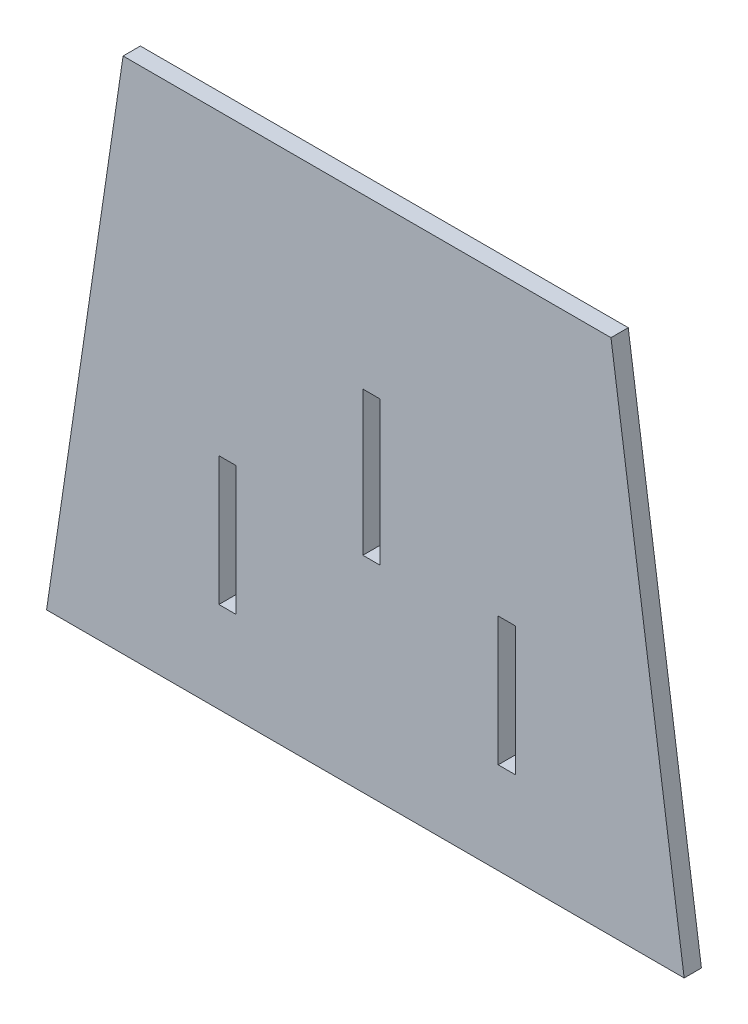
ISO-10303-21;
HEADER;
FILE_DESCRIPTION(('STEP AP214'),'2;1');
FILE_NAME('part.step','',(''),(''),'','','');
FILE_SCHEMA(('AUTOMOTIVE_DESIGN { 1 0 10303 214 1 1 1 1 }'));
ENDSEC;
DATA;
#1=APPLICATION_CONTEXT('core data for automotive mechanical design processes');
#2=APPLICATION_PROTOCOL_DEFINITION('international standard','automotive_design',2000,#1);
#3=PRODUCT_CONTEXT('',#1,'mechanical');
#4=PRODUCT('Part','Part','',(#3));
#5=PRODUCT_RELATED_PRODUCT_CATEGORY('part','',(#4));
#6=PRODUCT_DEFINITION_FORMATION('','',#4);
#7=PRODUCT_DEFINITION_CONTEXT('part definition',#1,'design');
#8=PRODUCT_DEFINITION('design','',#6,#7);
#9=PRODUCT_DEFINITION_SHAPE('','',#8);
#10=(LENGTH_UNIT() NAMED_UNIT(*) SI_UNIT(.MILLI.,.METRE.));
#11=(NAMED_UNIT(*) PLANE_ANGLE_UNIT() SI_UNIT($,.RADIAN.));
#12=(NAMED_UNIT(*) SI_UNIT($,.STERADIAN.) SOLID_ANGLE_UNIT());
#13=UNCERTAINTY_MEASURE_WITH_UNIT(LENGTH_MEASURE(1.E-05),#10,'distance_accuracy_value','');
#14=(GEOMETRIC_REPRESENTATION_CONTEXT(3) GLOBAL_UNCERTAINTY_ASSIGNED_CONTEXT((#13)) GLOBAL_UNIT_ASSIGNED_CONTEXT((#10,
#11,#12)) REPRESENTATION_CONTEXT('',''));
#15=CARTESIAN_POINT('',(0.,0.,0.));
#16=DIRECTION('',(0.,0.,1.));
#17=DIRECTION('',(1.,0.,0.));
#18=AXIS2_PLACEMENT_3D('',#15,#16,#17);
#19=CARTESIAN_POINT('',(0.,0.,1.524));
#20=DIRECTION('',(0.,0.,-1.));
#21=DIRECTION('',(-1.,0.,0.));
#22=AXIS2_PLACEMENT_3D('',#19,#20,#21);
#23=PLANE('',#22);
#24=DIRECTION('',(-1.,0.,0.));
#25=VECTOR('',#24,1.);
#26=CARTESIAN_POINT('',(-12.699778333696,7.53026337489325,1.524));
#27=LINE('',#26,#25);
#28=CARTESIAN_POINT('',(-11.175778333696,7.53026337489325,1.524));
#29=VERTEX_POINT('',#28);
#30=CARTESIAN_POINT('',(-12.699778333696,7.53026337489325,1.524));
#31=VERTEX_POINT('',#30);
#32=EDGE_CURVE('E158',#29,#31,#27,.T.);
#33=ORIENTED_EDGE('',*,*,#32,.F.);
#34=DIRECTION('',(0.,1.,0.));
#35=VECTOR('',#34,1.);
#36=CARTESIAN_POINT('',(-11.175778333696,7.53026337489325,1.524));
#37=LINE('',#36,#35);
#38=CARTESIAN_POINT('',(-11.175778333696,-3.84013346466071,1.524));
#39=VERTEX_POINT('',#38);
#40=EDGE_CURVE('E49',#39,#29,#37,.T.);
#41=ORIENTED_EDGE('',*,*,#40,.F.);
#42=DIRECTION('',(1.,0.,0.));
#43=VECTOR('',#42,1.);
#44=CARTESIAN_POINT('',(-11.175778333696,-3.84013346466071,1.524));
#45=LINE('',#44,#43);
#46=CARTESIAN_POINT('',(-12.699778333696,-3.84013346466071,1.524));
#47=VERTEX_POINT('',#46);
#48=EDGE_CURVE('E164',#47,#39,#45,.T.);
#49=ORIENTED_EDGE('',*,*,#48,.F.);
#50=DIRECTION('',(0.,-1.,0.));
#51=VECTOR('',#50,1.);
#52=CARTESIAN_POINT('',(-12.699778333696,7.53026337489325,1.524));
#53=LINE('',#52,#51);
#54=EDGE_CURVE('E149',#31,#47,#53,.T.);
#55=ORIENTED_EDGE('',*,*,#54,.F.);
#56=EDGE_LOOP('',(#33,#41,#49,#55));
#57=FACE_BOUND('',#56,.T.);
#58=DIRECTION('',(-1.,0.,0.));
#59=VECTOR('',#58,1.);
#60=CARTESIAN_POINT('',(13.462,7.60094576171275,1.524));
#61=LINE('',#60,#59);
#62=CARTESIAN_POINT('',(13.462,7.60094576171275,1.524));
#63=VERTEX_POINT('',#62);
#64=CARTESIAN_POINT('',(11.938,7.60094576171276,1.524));
#65=VERTEX_POINT('',#64);
#66=EDGE_CURVE('E175',#63,#65,#61,.T.);
#67=ORIENTED_EDGE('',*,*,#66,.F.);
#68=DIRECTION('',(0.,1.,0.));
#69=VECTOR('',#68,1.);
#70=CARTESIAN_POINT('',(13.462,7.60094576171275,1.524));
#71=LINE('',#70,#69);
#72=CARTESIAN_POINT('',(13.462,-3.76945107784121,1.524));
#73=VERTEX_POINT('',#72);
#74=EDGE_CURVE('E171',#73,#63,#71,.T.);
#75=ORIENTED_EDGE('',*,*,#74,.F.);
#76=DIRECTION('',(1.,0.,0.));
#77=VECTOR('',#76,1.);
#78=CARTESIAN_POINT('',(11.938,-3.76945107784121,1.524));
#79=LINE('',#78,#77);
#80=CARTESIAN_POINT('',(11.938,-3.76945107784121,1.524));
#81=VERTEX_POINT('',#80);
#82=EDGE_CURVE('E181',#81,#73,#79,.T.);
#83=ORIENTED_EDGE('',*,*,#82,.F.);
#84=DIRECTION('',(0.,-1.,0.));
#85=VECTOR('',#84,1.);
#86=CARTESIAN_POINT('',(11.938,7.60094576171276,1.524));
#87=LINE('',#86,#85);
#88=EDGE_CURVE('E178',#65,#81,#87,.T.);
#89=ORIENTED_EDGE('',*,*,#88,.F.);
#90=EDGE_LOOP('',(#67,#75,#83,#89));
#91=FACE_BOUND('',#90,.T.);
#92=DIRECTION('',(-0.139917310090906,0.99016319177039,0.));
#93=VECTOR('',#92,1.);
#94=CARTESIAN_POINT('',(21.8872196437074,33.8389539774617,1.524));
#95=LINE('',#94,#93);
#96=CARTESIAN_POINT('',(28.3437717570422,-11.8526065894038,1.524));
#97=VERTEX_POINT('',#96);
#98=CARTESIAN_POINT('',(21.8872196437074,33.8389539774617,1.524));
#99=VERTEX_POINT('',#98);
#100=EDGE_CURVE('E225',#97,#99,#95,.T.);
#101=ORIENTED_EDGE('',*,*,#100,.T.);
#102=DIRECTION('',(-1.,0.,0.));
#103=VECTOR('',#102,1.);
#104=CARTESIAN_POINT('',(-21.1523757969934,33.8389539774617,1.524));
#105=LINE('',#104,#103);
#106=CARTESIAN_POINT('',(-21.1523757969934,33.8389539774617,1.524));
#107=VERTEX_POINT('',#106);
#108=EDGE_CURVE('E228',#99,#107,#105,.T.);
#109=ORIENTED_EDGE('',*,*,#108,.T.);
#110=DIRECTION('',(-0.146140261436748,-0.989263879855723,0.));
#111=VECTOR('',#110,1.);
#112=CARTESIAN_POINT('',(-27.9022195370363,-11.8526065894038,1.524));
#113=LINE('',#112,#111);
#114=CARTESIAN_POINT('',(-27.9022195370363,-11.8526065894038,1.524));
#115=VERTEX_POINT('',#114);
#116=EDGE_CURVE('E231',#107,#115,#113,.T.);
#117=ORIENTED_EDGE('',*,*,#116,.T.);
#118=DIRECTION('',(1.,0.,0.));
#119=VECTOR('',#118,1.);
#120=CARTESIAN_POINT('',(28.3437717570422,-11.8526065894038,1.524));
#121=LINE('',#120,#119);
#122=EDGE_CURVE('E233',#115,#97,#121,.T.);
#123=ORIENTED_EDGE('',*,*,#122,.T.);
#124=EDGE_LOOP('',(#101,#109,#117,#123));
#125=FACE_BOUND('',#124,.T.);
#126=DIRECTION('',(0.,1.,0.));
#127=VECTOR('',#126,1.);
#128=CARTESIAN_POINT('',(1.524,6.27134260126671,1.524));
#129=LINE('',#128,#127);
#130=CARTESIAN_POINT('',(1.524,6.27134260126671,1.524));
#131=VERTEX_POINT('',#130);
#132=CARTESIAN_POINT('',(1.524,18.9713426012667,1.524));
#133=VERTEX_POINT('',#132);
#134=EDGE_CURVE('E194',#131,#133,#129,.T.);
#135=ORIENTED_EDGE('',*,*,#134,.F.);
#136=DIRECTION('',(1.,0.,0.));
#137=VECTOR('',#136,1.);
#138=CARTESIAN_POINT('',(1.524,6.27134260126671,1.524));
#139=LINE('',#138,#137);
#140=CARTESIAN_POINT('',(0.,6.27134260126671,1.524));
#141=VERTEX_POINT('',#140);
#142=EDGE_CURVE('E202',#141,#131,#139,.T.);
#143=ORIENTED_EDGE('',*,*,#142,.F.);
#144=DIRECTION('',(0.,-1.,0.));
#145=VECTOR('',#144,1.);
#146=CARTESIAN_POINT('',(0.,6.27134260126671,1.524));
#147=LINE('',#146,#145);
#148=CARTESIAN_POINT('',(0.,18.9713426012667,1.524));
#149=VERTEX_POINT('',#148);
#150=EDGE_CURVE('E199',#149,#141,#147,.T.);
#151=ORIENTED_EDGE('',*,*,#150,.F.);
#152=DIRECTION('',(-1.,0.,0.));
#153=VECTOR('',#152,1.);
#154=CARTESIAN_POINT('',(1.524,18.9713426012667,1.524));
#155=LINE('',#154,#153);
#156=EDGE_CURVE('E196',#133,#149,#155,.T.);
#157=ORIENTED_EDGE('',*,*,#156,.F.);
#158=EDGE_LOOP('',(#135,#143,#151,#157));
#159=FACE_BOUND('',#158,.T.);
#160=ADVANCED_FACE('F34',(#57,#91,#125,#159),#23,.F.);
#161=CARTESIAN_POINT('',(0.,0.,0.));
#162=DIRECTION('',(0.,0.,-1.));
#163=DIRECTION('',(-1.,0.,0.));
#164=AXIS2_PLACEMENT_3D('',#161,#162,#163);
#165=PLANE('',#164);
#166=DIRECTION('',(0.,-1.,0.));
#167=VECTOR('',#166,1.);
#168=CARTESIAN_POINT('',(-11.175778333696,0.,0.));
#169=LINE('',#168,#167);
#170=CARTESIAN_POINT('',(-11.175778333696,7.53026337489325,0.));
#171=VERTEX_POINT('',#170);
#172=CARTESIAN_POINT('',(-11.175778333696,-3.84013346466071,0.));
#173=VERTEX_POINT('',#172);
#174=EDGE_CURVE('E11',#171,#173,#169,.T.);
#175=ORIENTED_EDGE('',*,*,#174,.F.);
#176=DIRECTION('',(1.,0.,0.));
#177=VECTOR('',#176,1.);
#178=CARTESIAN_POINT('',(0.,7.53026337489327,0.));
#179=LINE('',#178,#177);
#180=CARTESIAN_POINT('',(-12.699778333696,7.53026337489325,0.));
#181=VERTEX_POINT('',#180);
#182=EDGE_CURVE('E263',#181,#171,#179,.T.);
#183=ORIENTED_EDGE('',*,*,#182,.F.);
#184=DIRECTION('',(0.,1.,0.));
#185=VECTOR('',#184,1.);
#186=CARTESIAN_POINT('',(-12.699778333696,0.,0.));
#187=LINE('',#186,#185);
#188=CARTESIAN_POINT('',(-12.699778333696,-3.84013346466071,0.));
#189=VERTEX_POINT('',#188);
#190=EDGE_CURVE('E152',#189,#181,#187,.T.);
#191=ORIENTED_EDGE('',*,*,#190,.F.);
#192=DIRECTION('',(-1.,0.,0.));
#193=VECTOR('',#192,1.);
#194=CARTESIAN_POINT('',(0.,-3.84013346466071,0.));
#195=LINE('',#194,#193);
#196=EDGE_CURVE('E42',#173,#189,#195,.T.);
#197=ORIENTED_EDGE('',*,*,#196,.F.);
#198=EDGE_LOOP('',(#175,#183,#191,#197));
#199=FACE_BOUND('',#198,.T.);
#200=DIRECTION('',(0.,-1.,0.));
#201=VECTOR('',#200,1.);
#202=CARTESIAN_POINT('',(13.462,0.,0.));
#203=LINE('',#202,#201);
#204=CARTESIAN_POINT('',(13.462,7.60094576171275,0.));
#205=VERTEX_POINT('',#204);
#206=CARTESIAN_POINT('',(13.462,-3.76945107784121,0.));
#207=VERTEX_POINT('',#206);
#208=EDGE_CURVE('E261',#205,#207,#203,.T.);
#209=ORIENTED_EDGE('',*,*,#208,.F.);
#210=DIRECTION('',(1.,0.,0.));
#211=VECTOR('',#210,1.);
#212=CARTESIAN_POINT('',(0.,7.60094576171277,0.));
#213=LINE('',#212,#211);
#214=CARTESIAN_POINT('',(11.938,7.60094576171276,0.));
#215=VERTEX_POINT('',#214);
#216=EDGE_CURVE('E254',#215,#205,#213,.T.);
#217=ORIENTED_EDGE('',*,*,#216,.F.);
#218=DIRECTION('',(0.,1.,0.));
#219=VECTOR('',#218,1.);
#220=CARTESIAN_POINT('',(11.938,0.,0.));
#221=LINE('',#220,#219);
#222=CARTESIAN_POINT('',(11.938,-3.76945107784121,0.));
#223=VERTEX_POINT('',#222);
#224=EDGE_CURVE('E256',#223,#215,#221,.T.);
#225=ORIENTED_EDGE('',*,*,#224,.F.);
#226=DIRECTION('',(-1.,0.,0.));
#227=VECTOR('',#226,1.);
#228=CARTESIAN_POINT('',(0.,-3.76945107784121,0.));
#229=LINE('',#228,#227);
#230=EDGE_CURVE('E259',#207,#223,#229,.T.);
#231=ORIENTED_EDGE('',*,*,#230,.F.);
#232=EDGE_LOOP('',(#209,#217,#225,#231));
#233=FACE_BOUND('',#232,.T.);
#234=DIRECTION('',(-0.139917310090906,0.99016319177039,0.));
#235=VECTOR('',#234,1.);
#236=CARTESIAN_POINT('',(21.8872196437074,33.8389539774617,0.));
#237=LINE('',#236,#235);
#238=CARTESIAN_POINT('',(28.3437717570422,-11.8526065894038,0.));
#239=VERTEX_POINT('',#238);
#240=CARTESIAN_POINT('',(21.8872196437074,33.8389539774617,0.));
#241=VERTEX_POINT('',#240);
#242=EDGE_CURVE('E224',#239,#241,#237,.T.);
#243=ORIENTED_EDGE('',*,*,#242,.F.);
#244=DIRECTION('',(1.,0.,0.));
#245=VECTOR('',#244,1.);
#246=CARTESIAN_POINT('',(28.3437717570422,-11.8526065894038,0.));
#247=LINE('',#246,#245);
#248=CARTESIAN_POINT('',(-27.9022195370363,-11.8526065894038,0.));
#249=VERTEX_POINT('',#248);
#250=EDGE_CURVE('E229',#249,#239,#247,.T.);
#251=ORIENTED_EDGE('',*,*,#250,.F.);
#252=DIRECTION('',(-0.146140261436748,-0.989263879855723,0.));
#253=VECTOR('',#252,1.);
#254=CARTESIAN_POINT('',(-27.9022195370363,-11.8526065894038,0.));
#255=LINE('',#254,#253);
#256=CARTESIAN_POINT('',(-21.1523757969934,33.8389539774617,0.));
#257=VERTEX_POINT('',#256);
#258=EDGE_CURVE('E240',#257,#249,#255,.T.);
#259=ORIENTED_EDGE('',*,*,#258,.F.);
#260=DIRECTION('',(-1.,0.,0.));
#261=VECTOR('',#260,1.);
#262=CARTESIAN_POINT('',(-21.1523757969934,33.8389539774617,0.));
#263=LINE('',#262,#261);
#264=EDGE_CURVE('E238',#241,#257,#263,.T.);
#265=ORIENTED_EDGE('',*,*,#264,.F.);
#266=EDGE_LOOP('',(#243,#251,#259,#265));
#267=FACE_BOUND('',#266,.T.);
#268=DIRECTION('',(1.,0.,0.));
#269=VECTOR('',#268,1.);
#270=CARTESIAN_POINT('',(1.524,6.27134260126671,0.));
#271=LINE('',#270,#269);
#272=CARTESIAN_POINT('',(0.,6.27134260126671,0.));
#273=VERTEX_POINT('',#272);
#274=CARTESIAN_POINT('',(1.524,6.27134260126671,0.));
#275=VERTEX_POINT('',#274);
#276=EDGE_CURVE('E197',#273,#275,#271,.T.);
#277=ORIENTED_EDGE('',*,*,#276,.T.);
#278=DIRECTION('',(0.,1.,0.));
#279=VECTOR('',#278,1.);
#280=CARTESIAN_POINT('',(1.524,6.27134260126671,0.));
#281=LINE('',#280,#279);
#282=CARTESIAN_POINT('',(1.524,18.9713426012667,0.));
#283=VERTEX_POINT('',#282);
#284=EDGE_CURVE('E187',#275,#283,#281,.T.);
#285=ORIENTED_EDGE('',*,*,#284,.T.);
#286=DIRECTION('',(-1.,0.,0.));
#287=VECTOR('',#286,1.);
#288=CARTESIAN_POINT('',(1.524,18.9713426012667,0.));
#289=LINE('',#288,#287);
#290=CARTESIAN_POINT('',(0.,18.9713426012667,0.));
#291=VERTEX_POINT('',#290);
#292=EDGE_CURVE('E207',#283,#291,#289,.T.);
#293=ORIENTED_EDGE('',*,*,#292,.T.);
#294=DIRECTION('',(0.,-1.,0.));
#295=VECTOR('',#294,1.);
#296=CARTESIAN_POINT('',(0.,6.27134260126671,0.));
#297=LINE('',#296,#295);
#298=EDGE_CURVE('E210',#291,#273,#297,.T.);
#299=ORIENTED_EDGE('',*,*,#298,.T.);
#300=EDGE_LOOP('',(#277,#285,#293,#299));
#301=FACE_BOUND('',#300,.T.);
#302=ADVANCED_FACE('F271',(#199,#233,#267,#301),#165,.T.);
#303=CARTESIAN_POINT('',(21.8872196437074,33.8389539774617,1.524));
#304=DIRECTION('',(-0.99016319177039,-0.139917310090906,0.));
#305=DIRECTION('',(0.139917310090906,-0.99016319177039,0.));
#306=AXIS2_PLACEMENT_3D('',#303,#304,#305);
#307=PLANE('',#306);
#308=ORIENTED_EDGE('',*,*,#242,.T.);
#309=DIRECTION('',(0.,0.,-1.));
#310=VECTOR('',#309,1.);
#311=CARTESIAN_POINT('',(21.8872196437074,33.8389539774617,1.524));
#312=LINE('',#311,#310);
#313=EDGE_CURVE('E251',#99,#241,#312,.T.);
#314=ORIENTED_EDGE('',*,*,#313,.F.);
#315=ORIENTED_EDGE('',*,*,#100,.F.);
#316=DIRECTION('',(0.,0.,-1.));
#317=VECTOR('',#316,1.);
#318=CARTESIAN_POINT('',(28.3437717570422,-11.8526065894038,1.524));
#319=LINE('',#318,#317);
#320=EDGE_CURVE('E235',#97,#239,#319,.T.);
#321=ORIENTED_EDGE('',*,*,#320,.T.);
#322=EDGE_LOOP('',(#308,#314,#315,#321));
#323=FACE_BOUND('',#322,.T.);
#324=ADVANCED_FACE('F36',(#323),#307,.F.);
#325=CARTESIAN_POINT('',(-21.1523757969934,33.8389539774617,1.524));
#326=DIRECTION('',(0.,-1.,0.));
#327=DIRECTION('',(0.,0.,-1.));
#328=AXIS2_PLACEMENT_3D('',#325,#326,#327);
#329=PLANE('',#328);
#330=ORIENTED_EDGE('',*,*,#264,.T.);
#331=DIRECTION('',(0.,0.,-1.));
#332=VECTOR('',#331,1.);
#333=CARTESIAN_POINT('',(-21.1523757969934,33.8389539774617,1.524));
#334=LINE('',#333,#332);
#335=EDGE_CURVE('E248',#107,#257,#334,.T.);
#336=ORIENTED_EDGE('',*,*,#335,.F.);
#337=ORIENTED_EDGE('',*,*,#108,.F.);
#338=ORIENTED_EDGE('',*,*,#313,.T.);
#339=EDGE_LOOP('',(#330,#336,#337,#338));
#340=FACE_BOUND('',#339,.T.);
#341=ADVANCED_FACE('F303',(#340),#329,.F.);
#342=CARTESIAN_POINT('',(-27.9022195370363,-11.8526065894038,1.524));
#343=DIRECTION('',(0.989263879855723,-0.146140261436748,0.));
#344=DIRECTION('',(0.146140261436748,0.989263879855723,0.));
#345=AXIS2_PLACEMENT_3D('',#342,#343,#344);
#346=PLANE('',#345);
#347=ORIENTED_EDGE('',*,*,#258,.T.);
#348=DIRECTION('',(0.,0.,-1.));
#349=VECTOR('',#348,1.);
#350=CARTESIAN_POINT('',(-27.9022195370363,-11.8526065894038,1.524));
#351=LINE('',#350,#349);
#352=EDGE_CURVE('E245',#115,#249,#351,.T.);
#353=ORIENTED_EDGE('',*,*,#352,.F.);
#354=ORIENTED_EDGE('',*,*,#116,.F.);
#355=ORIENTED_EDGE('',*,*,#335,.T.);
#356=EDGE_LOOP('',(#347,#353,#354,#355));
#357=FACE_BOUND('',#356,.T.);
#358=ADVANCED_FACE('F300',(#357),#346,.F.);
#359=CARTESIAN_POINT('',(28.3437717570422,-11.8526065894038,1.524));
#360=DIRECTION('',(0.,1.,0.));
#361=DIRECTION('',(0.,0.,1.));
#362=AXIS2_PLACEMENT_3D('',#359,#360,#361);
#363=PLANE('',#362);
#364=ORIENTED_EDGE('',*,*,#250,.T.);
#365=ORIENTED_EDGE('',*,*,#320,.F.);
#366=ORIENTED_EDGE('',*,*,#122,.F.);
#367=ORIENTED_EDGE('',*,*,#352,.T.);
#368=EDGE_LOOP('',(#364,#365,#366,#367));
#369=FACE_BOUND('',#368,.T.);
#370=ADVANCED_FACE('F297',(#369),#363,.F.);
#371=CARTESIAN_POINT('',(1.524,6.27134260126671,1.524));
#372=DIRECTION('',(-1.,0.,0.));
#373=DIRECTION('',(0.,0.,1.));
#374=AXIS2_PLACEMENT_3D('',#371,#372,#373);
#375=PLANE('',#374);
#376=ORIENTED_EDGE('',*,*,#284,.F.);
#377=DIRECTION('',(0.,0.,-1.));
#378=VECTOR('',#377,1.);
#379=CARTESIAN_POINT('',(1.524,6.27134260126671,1.524));
#380=LINE('',#379,#378);
#381=EDGE_CURVE('E204',#131,#275,#380,.T.);
#382=ORIENTED_EDGE('',*,*,#381,.F.);
#383=ORIENTED_EDGE('',*,*,#134,.T.);
#384=DIRECTION('',(0.,0.,-1.));
#385=VECTOR('',#384,1.);
#386=CARTESIAN_POINT('',(1.524,18.9713426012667,1.524));
#387=LINE('',#386,#385);
#388=EDGE_CURVE('E221',#133,#283,#387,.T.);
#389=ORIENTED_EDGE('',*,*,#388,.T.);
#390=EDGE_LOOP('',(#376,#382,#383,#389));
#391=FACE_BOUND('',#390,.T.);
#392=ADVANCED_FACE('F294',(#391),#375,.T.);
#393=CARTESIAN_POINT('',(1.524,18.9713426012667,1.524));
#394=DIRECTION('',(0.,-1.,0.));
#395=DIRECTION('',(0.,0.,-1.));
#396=AXIS2_PLACEMENT_3D('',#393,#394,#395);
#397=PLANE('',#396);
#398=ORIENTED_EDGE('',*,*,#292,.F.);
#399=ORIENTED_EDGE('',*,*,#388,.F.);
#400=ORIENTED_EDGE('',*,*,#156,.T.);
#401=DIRECTION('',(0.,0.,-1.));
#402=VECTOR('',#401,1.);
#403=CARTESIAN_POINT('',(0.,18.9713426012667,1.524));
#404=LINE('',#403,#402);
#405=EDGE_CURVE('E219',#149,#291,#404,.T.);
#406=ORIENTED_EDGE('',*,*,#405,.T.);
#407=EDGE_LOOP('',(#398,#399,#400,#406));
#408=FACE_BOUND('',#407,.T.);
#409=ADVANCED_FACE('F333',(#408),#397,.T.);
#410=CARTESIAN_POINT('',(0.,6.27134260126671,1.524));
#411=DIRECTION('',(1.,0.,0.));
#412=DIRECTION('',(0.,0.,-1.));
#413=AXIS2_PLACEMENT_3D('',#410,#411,#412);
#414=PLANE('',#413);
#415=ORIENTED_EDGE('',*,*,#298,.F.);
#416=ORIENTED_EDGE('',*,*,#405,.F.);
#417=ORIENTED_EDGE('',*,*,#150,.T.);
#418=DIRECTION('',(0.,0.,-1.));
#419=VECTOR('',#418,1.);
#420=CARTESIAN_POINT('',(0.,6.27134260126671,1.524));
#421=LINE('',#420,#419);
#422=EDGE_CURVE('E217',#141,#273,#421,.T.);
#423=ORIENTED_EDGE('',*,*,#422,.T.);
#424=EDGE_LOOP('',(#415,#416,#417,#423));
#425=FACE_BOUND('',#424,.T.);
#426=ADVANCED_FACE('F340',(#425),#414,.T.);
#427=CARTESIAN_POINT('',(1.524,6.27134260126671,1.524));
#428=DIRECTION('',(0.,1.,0.));
#429=DIRECTION('',(0.,0.,1.));
#430=AXIS2_PLACEMENT_3D('',#427,#428,#429);
#431=PLANE('',#430);
#432=ORIENTED_EDGE('',*,*,#276,.F.);
#433=ORIENTED_EDGE('',*,*,#422,.F.);
#434=ORIENTED_EDGE('',*,*,#142,.T.);
#435=ORIENTED_EDGE('',*,*,#381,.T.);
#436=EDGE_LOOP('',(#432,#433,#434,#435));
#437=FACE_BOUND('',#436,.T.);
#438=ADVANCED_FACE('F338',(#437),#431,.T.);
#439=CARTESIAN_POINT('',(13.462,7.60094576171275,-1.016));
#440=DIRECTION('',(1.,0.,0.));
#441=DIRECTION('',(0.,0.,-1.));
#442=AXIS2_PLACEMENT_3D('',#439,#440,#441);
#443=PLANE('',#442);
#444=ORIENTED_EDGE('',*,*,#208,.T.);
#445=DIRECTION('',(0.,0.,1.));
#446=VECTOR('',#445,1.);
#447=CARTESIAN_POINT('',(13.462,-3.76945107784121,-1.016));
#448=LINE('',#447,#446);
#449=EDGE_CURVE('E185',#207,#73,#448,.T.);
#450=ORIENTED_EDGE('',*,*,#449,.T.);
#451=ORIENTED_EDGE('',*,*,#74,.T.);
#452=DIRECTION('',(0.,0.,1.));
#453=VECTOR('',#452,1.);
#454=CARTESIAN_POINT('',(13.462,7.60094576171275,-1.016));
#455=LINE('',#454,#453);
#456=EDGE_CURVE('E184',#205,#63,#455,.T.);
#457=ORIENTED_EDGE('',*,*,#456,.F.);
#458=EDGE_LOOP('',(#444,#450,#451,#457));
#459=FACE_BOUND('',#458,.T.);
#460=ADVANCED_FACE('F347',(#459),#443,.F.);
#461=CARTESIAN_POINT('',(11.938,-3.76945107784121,-1.016));
#462=DIRECTION('',(0.,-1.,0.));
#463=DIRECTION('',(0.,0.,-1.));
#464=AXIS2_PLACEMENT_3D('',#461,#462,#463);
#465=PLANE('',#464);
#466=ORIENTED_EDGE('',*,*,#230,.T.);
#467=DIRECTION('',(0.,0.,1.));
#468=VECTOR('',#467,1.);
#469=CARTESIAN_POINT('',(11.938,-3.76945107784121,-1.016));
#470=LINE('',#469,#468);
#471=EDGE_CURVE('E188',#223,#81,#470,.T.);
#472=ORIENTED_EDGE('',*,*,#471,.T.);
#473=ORIENTED_EDGE('',*,*,#82,.T.);
#474=ORIENTED_EDGE('',*,*,#449,.F.);
#475=EDGE_LOOP('',(#466,#472,#473,#474));
#476=FACE_BOUND('',#475,.T.);
#477=ADVANCED_FACE('F351',(#476),#465,.F.);
#478=CARTESIAN_POINT('',(11.938,7.60094576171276,-1.016));
#479=DIRECTION('',(-1.,0.,0.));
#480=DIRECTION('',(0.,0.,1.));
#481=AXIS2_PLACEMENT_3D('',#478,#479,#480);
#482=PLANE('',#481);
#483=ORIENTED_EDGE('',*,*,#224,.T.);
#484=DIRECTION('',(0.,0.,1.));
#485=VECTOR('',#484,1.);
#486=CARTESIAN_POINT('',(11.938,7.60094576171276,-1.016));
#487=LINE('',#486,#485);
#488=EDGE_CURVE('E190',#215,#65,#487,.T.);
#489=ORIENTED_EDGE('',*,*,#488,.T.);
#490=ORIENTED_EDGE('',*,*,#88,.T.);
#491=ORIENTED_EDGE('',*,*,#471,.F.);
#492=EDGE_LOOP('',(#483,#489,#490,#491));
#493=FACE_BOUND('',#492,.T.);
#494=ADVANCED_FACE('F282',(#493),#482,.F.);
#495=CARTESIAN_POINT('',(13.462,7.60094576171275,-1.016));
#496=DIRECTION('',(0.,1.,0.));
#497=DIRECTION('',(-1.,0.,0.));
#498=AXIS2_PLACEMENT_3D('',#495,#496,#497);
#499=PLANE('',#498);
#500=ORIENTED_EDGE('',*,*,#216,.T.);
#501=ORIENTED_EDGE('',*,*,#456,.T.);
#502=ORIENTED_EDGE('',*,*,#66,.T.);
#503=ORIENTED_EDGE('',*,*,#488,.F.);
#504=EDGE_LOOP('',(#500,#501,#502,#503));
#505=FACE_BOUND('',#504,.T.);
#506=ADVANCED_FACE('F275',(#505),#499,.F.);
#507=CARTESIAN_POINT('',(-11.175778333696,7.53026337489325,-1.016));
#508=DIRECTION('',(1.,0.,0.));
#509=DIRECTION('',(0.,0.,-1.));
#510=AXIS2_PLACEMENT_3D('',#507,#508,#509);
#511=PLANE('',#510);
#512=ORIENTED_EDGE('',*,*,#174,.T.);
#513=DIRECTION('',(0.,0.,1.));
#514=VECTOR('',#513,1.);
#515=CARTESIAN_POINT('',(-11.175778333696,-3.84013346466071,-1.016));
#516=LINE('',#515,#514);
#517=EDGE_CURVE('E169',#173,#39,#516,.T.);
#518=ORIENTED_EDGE('',*,*,#517,.T.);
#519=ORIENTED_EDGE('',*,*,#40,.T.);
#520=DIRECTION('',(0.,0.,1.));
#521=VECTOR('',#520,1.);
#522=CARTESIAN_POINT('',(-11.175778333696,7.53026337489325,-1.016));
#523=LINE('',#522,#521);
#524=EDGE_CURVE('E155',#171,#29,#523,.T.);
#525=ORIENTED_EDGE('',*,*,#524,.F.);
#526=EDGE_LOOP('',(#512,#518,#519,#525));
#527=FACE_BOUND('',#526,.T.);
#528=ADVANCED_FACE('F273',(#527),#511,.F.);
#529=CARTESIAN_POINT('',(-11.175778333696,-3.84013346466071,-1.016));
#530=DIRECTION('',(0.,-1.,0.));
#531=DIRECTION('',(0.,0.,-1.));
#532=AXIS2_PLACEMENT_3D('',#529,#530,#531);
#533=PLANE('',#532);
#534=ORIENTED_EDGE('',*,*,#196,.T.);
#535=DIRECTION('',(0.,0.,1.));
#536=VECTOR('',#535,1.);
#537=CARTESIAN_POINT('',(-12.699778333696,-3.84013346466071,-1.016));
#538=LINE('',#537,#536);
#539=EDGE_CURVE('E154',#189,#47,#538,.T.);
#540=ORIENTED_EDGE('',*,*,#539,.T.);
#541=ORIENTED_EDGE('',*,*,#48,.T.);
#542=ORIENTED_EDGE('',*,*,#517,.F.);
#543=EDGE_LOOP('',(#534,#540,#541,#542));
#544=FACE_BOUND('',#543,.T.);
#545=ADVANCED_FACE('F268',(#544),#533,.F.);
#546=CARTESIAN_POINT('',(-12.699778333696,7.53026337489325,-1.016));
#547=DIRECTION('',(-1.,0.,0.));
#548=DIRECTION('',(0.,0.,1.));
#549=AXIS2_PLACEMENT_3D('',#546,#547,#548);
#550=PLANE('',#549);
#551=ORIENTED_EDGE('',*,*,#190,.T.);
#552=DIRECTION('',(0.,0.,1.));
#553=VECTOR('',#552,1.);
#554=CARTESIAN_POINT('',(-12.699778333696,7.53026337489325,-1.016));
#555=LINE('',#554,#553);
#556=EDGE_CURVE('E57',#181,#31,#555,.T.);
#557=ORIENTED_EDGE('',*,*,#556,.T.);
#558=ORIENTED_EDGE('',*,*,#54,.T.);
#559=ORIENTED_EDGE('',*,*,#539,.F.);
#560=EDGE_LOOP('',(#551,#557,#558,#559));
#561=FACE_BOUND('',#560,.T.);
#562=ADVANCED_FACE('F146',(#561),#550,.F.);
#563=CARTESIAN_POINT('',(-12.699778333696,7.53026337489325,-1.016));
#564=DIRECTION('',(0.,1.,0.));
#565=DIRECTION('',(-1.,0.,0.));
#566=AXIS2_PLACEMENT_3D('',#563,#564,#565);
#567=PLANE('',#566);
#568=ORIENTED_EDGE('',*,*,#182,.T.);
#569=ORIENTED_EDGE('',*,*,#524,.T.);
#570=ORIENTED_EDGE('',*,*,#32,.T.);
#571=ORIENTED_EDGE('',*,*,#556,.F.);
#572=EDGE_LOOP('',(#568,#569,#570,#571));
#573=FACE_BOUND('',#572,.T.);
#574=ADVANCED_FACE('F159',(#573),#567,.F.);
#575=CLOSED_SHELL('',(#160,#302,#324,#341,#358,#370,#392,#409,#426,#438,#460,#477,#494,#506,
#528,#545,#562,#574));
#576=MANIFOLD_SOLID_BREP('B2',#575);
#577=ADVANCED_BREP_SHAPE_REPRESENTATION('',(#18,#576),#14);
#578=SHAPE_DEFINITION_REPRESENTATION(#9,#577);
ENDSEC;
END-ISO-10303-21;
